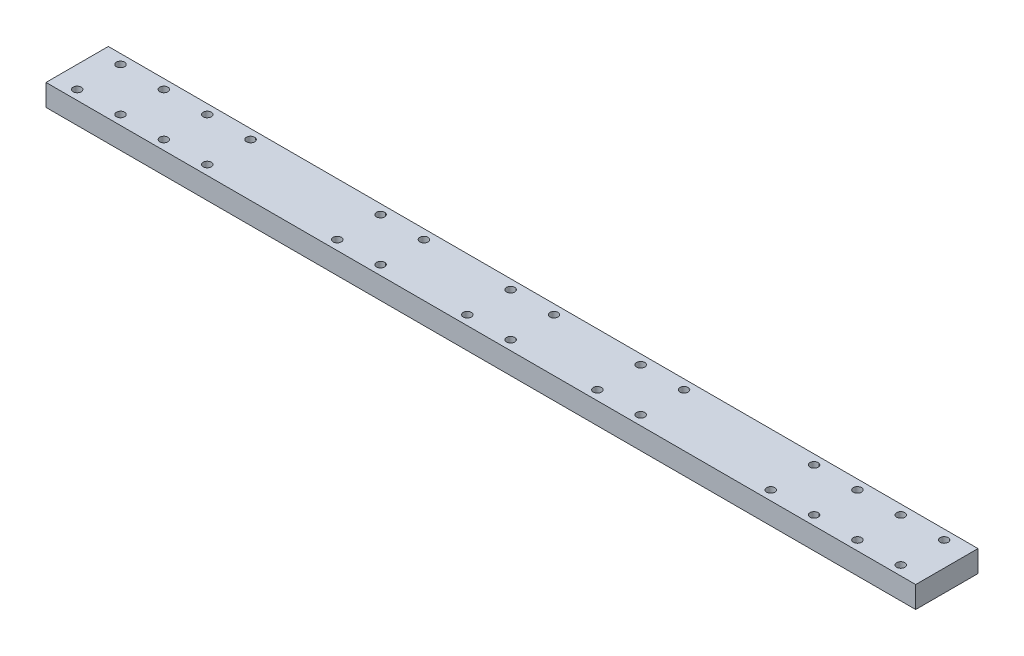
from build123d import *

# Parameters (mm, degrees)
SKETCH_1_W      = 321
SKETCH_1_H      = 23
SKETCH_1_R      = 1.5
EXTRUDE_1_DEPTH = 8


with BuildPart() as part:
    # Sketch 1 → Extrude 1 (new body)
    with BuildSketch(Plane(origin=(0, 0, 0), x_dir=(1, 0, 0), z_dir=(0, 1, 0))):
        with Locations((138.204638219, -1.36122449)):
            Rectangle(SKETCH_1_W, SKETCH_1_H)
        with Locations(Location((-14.295361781, 6.63877551, 0), (0, 0, 270))):
            Circle(SKETCH_1_R, mode=Mode.SUBTRACT)
        with Locations(Location((1.704638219, 6.63877551, 0), (0, 0, 270))):
            Circle(SKETCH_1_R, mode=Mode.SUBTRACT)
        with Locations(Location((17.704638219, 6.63877551, 0), (0, 0, 270))):
            Circle(SKETCH_1_R, mode=Mode.SUBTRACT)
        with Locations(Location((33.704638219, 6.63877551, 0), (0, 0, 270))):
            Circle(SKETCH_1_R, mode=Mode.SUBTRACT)
        with Locations(Location((-14.295361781, -9.36122449, 0), (0, 0, 270))):
            Circle(SKETCH_1_R, mode=Mode.SUBTRACT)
        with Locations(Location((1.704638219, -9.36122449, 0), (0, 0, 270))):
            Circle(SKETCH_1_R, mode=Mode.SUBTRACT)
        with Locations(Location((17.704638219, -9.36122449, 0), (0, 0, 270))):
            Circle(SKETCH_1_R, mode=Mode.SUBTRACT)
        with Locations(Location((33.704638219, -9.36122449, 0), (0, 0, 270))):
            Circle(SKETCH_1_R, mode=Mode.SUBTRACT)
        with Locations(Location((81.704638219, 6.63877551, 0), (0, 0, 270))):
            Circle(SKETCH_1_R, mode=Mode.SUBTRACT)
        with Locations(Location((97.704638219, 6.63877551, 0), (0, 0, 270))):
            Circle(SKETCH_1_R, mode=Mode.SUBTRACT)
        with Locations(Location((81.704638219, -9.36122449, 0), (0, 0, 270))):
            Circle(SKETCH_1_R, mode=Mode.SUBTRACT)
        with Locations(Location((97.704638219, -9.36122449, 0), (0, 0, 270))):
            Circle(SKETCH_1_R, mode=Mode.SUBTRACT)
        with Locations(Location((129.704638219, 6.63877551, 0), (0, 0, 270))):
            Circle(SKETCH_1_R, mode=Mode.SUBTRACT)
        with Locations(Location((145.704638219, 6.63877551, 0), (0, 0, 270))):
            Circle(SKETCH_1_R, mode=Mode.SUBTRACT)
        with Locations(Location((129.704638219, -9.36122449, 0), (0, 0, 270))):
            Circle(SKETCH_1_R, mode=Mode.SUBTRACT)
        with Locations(Location((145.704638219, -9.36122449, 0), (0, 0, 270))):
            Circle(SKETCH_1_R, mode=Mode.SUBTRACT)
        with Locations(Location((177.704638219, 6.63877551, 0), (0, 0, 270))):
            Circle(SKETCH_1_R, mode=Mode.SUBTRACT)
        with Locations(Location((193.704638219, 6.63877551, 0), (0, 0, 270))):
            Circle(SKETCH_1_R, mode=Mode.SUBTRACT)
        with Locations(Location((177.704638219, -9.36122449, 0), (0, 0, 270))):
            Circle(SKETCH_1_R, mode=Mode.SUBTRACT)
        with Locations(Location((193.704638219, -9.36122449, 0), (0, 0, 270))):
            Circle(SKETCH_1_R, mode=Mode.SUBTRACT)
        with Locations(Location((241.704638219, 6.63877551, 0), (0, 0, 270))):
            Circle(SKETCH_1_R, mode=Mode.SUBTRACT)
        with Locations(Location((257.704638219, 6.63877551, 0), (0, 0, 270))):
            Circle(SKETCH_1_R, mode=Mode.SUBTRACT)
        with Locations(Location((241.704638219, -9.36122449, 0), (0, 0, 270))):
            Circle(SKETCH_1_R, mode=Mode.SUBTRACT)
        with Locations(Location((257.704638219, -9.36122449, 0), (0, 0, 270))):
            Circle(SKETCH_1_R, mode=Mode.SUBTRACT)
        with Locations(Location((273.704638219, 6.63877551, 0), (0, 0, 270))):
            Circle(SKETCH_1_R, mode=Mode.SUBTRACT)
        with Locations(Location((289.704638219, 6.63877551, 0), (0, 0, 270))):
            Circle(SKETCH_1_R, mode=Mode.SUBTRACT)
        with Locations(Location((273.704638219, -9.36122449, 0), (0, 0, 270))):
            Circle(SKETCH_1_R, mode=Mode.SUBTRACT)
        with Locations(Location((289.704638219, -9.36122449, 0), (0, 0, 270))):
            Circle(SKETCH_1_R, mode=Mode.SUBTRACT)
    extrude(amount=EXTRUDE_1_DEPTH)


solid = part.part
